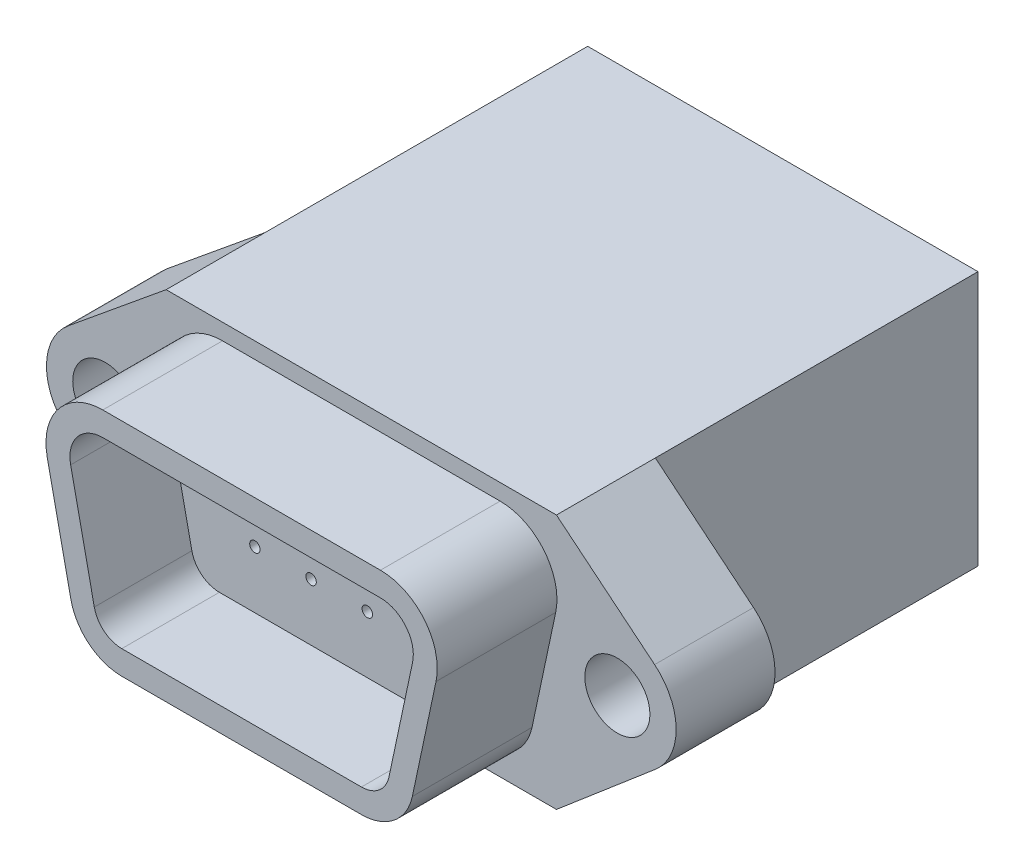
from build123d import *

# Parameters (mm, degrees)
SKETCH1_R           = 0.254
BASE_EXTRUDE_DEPTH  = 10.668
SKETCH2_R           = 1.5875
BOSS_EXTRUDE1_DEPTH = 4.826
CUT_EXTRUDE3_DEPTH  = 4.7625
SKETCH3_W           = 19.05
SKETCH3_H           = 12.446
BOSS_EXTRUDE2_DEPTH = 15.748


with BuildPart() as part:
    # Sketch1 → Base-Extrude (new body)
    with BuildSketch(Plane.XY):
        with BuildLine():
            Line((9.487854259, 0.638259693), (8.332916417, -4.795295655))
            ThreePointArc((8.332916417, -4.795295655), (7.446895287, -6.241150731), (5.848421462, -6.8072))
            Line((5.848421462, -6.8072), (-5.848421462, -6.8072))
            ThreePointArc((-5.848421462, -6.8072), (-7.446895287, -6.241150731), (-8.332916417, -4.795295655))
            Line((-8.332916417, -4.795295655), (-9.487854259, 0.638259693))
            ThreePointArc((-9.487854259, 0.638259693), (-8.930476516, 2.95990508), (-6.77545, 3.9878))
            Line((-6.77545, 3.9878), (6.77545, 3.9878))
            ThreePointArc((6.77545, 3.9878), (8.930476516, 2.95990508), (9.487854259, 0.638259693))
        make_face()
        with Locations((5.4864, 0)):
            Circle(SKETCH1_R, mode=Mode.SUBTRACT)
        with Locations((2.7432, 0)):
            Circle(SKETCH1_R, mode=Mode.SUBTRACT)
        Circle(SKETCH1_R, mode=Mode.SUBTRACT)
        with Locations((-2.7432, 0)):
            Circle(SKETCH1_R, mode=Mode.SUBTRACT)
        with Locations((-5.4864, 0)):
            Circle(SKETCH1_R, mode=Mode.SUBTRACT)
        with Locations((-4.1148, -2.8448)):
            Circle(SKETCH1_R, mode=Mode.SUBTRACT)
        with Locations((-1.3716, -2.8448)):
            Circle(SKETCH1_R, mode=Mode.SUBTRACT)
        with Locations((1.3716, -2.8448)):
            Circle(SKETCH1_R, mode=Mode.SUBTRACT)
        with Locations((4.1148, -2.8448)):
            Circle(SKETCH1_R, mode=Mode.SUBTRACT)
    extrude(amount=BASE_EXTRUDE_DEPTH)

    # Sketch2 → Boss-Extrude1 (add)
    with BuildSketch(Plane(origin=(7.968862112, 1.58821288, 0), x_dir=(-1, 0, 0), z_dir=(0, 0, -1))):
        with BuildLine():
            Line((17.493862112, 3.18698712), (-1.556137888, 3.18698712))
            Line((-1.556137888, 3.18698712), (-6.347358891, -0.739958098))
            ThreePointArc((-6.347358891, -0.739958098), (-7.398013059, -2.933044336), (-6.388446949, -5.145345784))
            Line((-6.388446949, -5.145345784), (-1.556137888, -9.25901288))
            Line((-1.556137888, -9.25901288), (17.493862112, -9.25901288))
            Line((17.493862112, -9.25901288), (22.326171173, -5.145345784))
            ThreePointArc((22.326171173, -5.145345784), (23.335737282, -2.933044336), (22.285083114, -0.739958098))
            Line((22.285083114, -0.739958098), (17.493862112, 3.18698712))
        make_face()
        with Locations((20.465662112, -2.95981288)):
            Circle(SKETCH2_R, mode=Mode.SUBTRACT)
        with Locations((-4.527937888, -2.95981288)):
            Circle(SKETCH2_R, mode=Mode.SUBTRACT)
    extrude(amount=-BOSS_EXTRUDE1_DEPTH)

    # Sketch9 → Cut-Extrude3 (cut)
    with BuildSketch(Plane.XY.offset(10.668)):
        with BuildLine():
            Line((6.77545, 2.8194), (-6.77545, 2.8194))
            ThreePointArc((-6.77545, 2.8194), (-8.022459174, 2.224607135), (-8.344986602, 0.881183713))
            Line((-8.344986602, 0.881183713), (-7.19004876, -4.552371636))
            ThreePointArc((-7.19004876, -4.552371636), (-6.711597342, -5.33313339), (-5.848421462, -5.6388))
            Line((-5.848421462, -5.6388), (5.848421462, -5.6388))
            ThreePointArc((5.848421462, -5.6388), (6.711597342, -5.33313339), (7.19004876, -4.552371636))
            Line((7.19004876, -4.552371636), (8.344986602, 0.881183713))
            ThreePointArc((8.344986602, 0.881183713), (8.022459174, 2.224607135), (6.77545, 2.8194))
        make_face()
    extrude(amount=-CUT_EXTRUDE3_DEPTH, mode=Mode.SUBTRACT)

    # Sketch3 → Boss-Extrude2 (add)
    with BuildSketch(Plane(origin=(4.148961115, -0.24842271, 0), x_dir=(-1, 0, 0), z_dir=(0, 0, -1))):
        with Locations((4.148961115, -1.19937729)):
            Rectangle(SKETCH3_W, SKETCH3_H)
    extrude(amount=BOSS_EXTRUDE2_DEPTH)


solid = part.part
